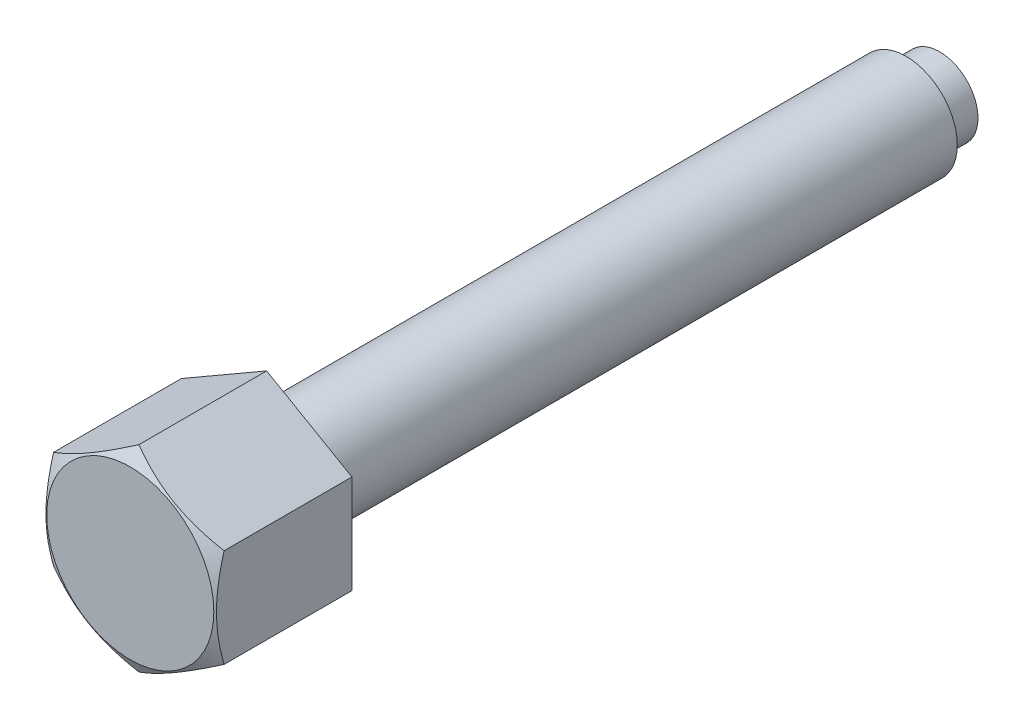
ISO-10303-21;
HEADER;
FILE_DESCRIPTION(('STEP AP214'),'2;1');
FILE_NAME('part.step','',(''),(''),'','','');
FILE_SCHEMA(('AUTOMOTIVE_DESIGN { 1 0 10303 214 1 1 1 1 }'));
ENDSEC;
DATA;
#1=APPLICATION_CONTEXT('core data for automotive mechanical design processes');
#2=APPLICATION_PROTOCOL_DEFINITION('international standard','automotive_design',2000,#1);
#3=PRODUCT_CONTEXT('',#1,'mechanical');
#4=PRODUCT('Part','Part','',(#3));
#5=PRODUCT_RELATED_PRODUCT_CATEGORY('part','',(#4));
#6=PRODUCT_DEFINITION_FORMATION('','',#4);
#7=PRODUCT_DEFINITION_CONTEXT('part definition',#1,'design');
#8=PRODUCT_DEFINITION('design','',#6,#7);
#9=PRODUCT_DEFINITION_SHAPE('','',#8);
#10=(LENGTH_UNIT() NAMED_UNIT(*) SI_UNIT(.MILLI.,.METRE.));
#11=(NAMED_UNIT(*) PLANE_ANGLE_UNIT() SI_UNIT($,.RADIAN.));
#12=(NAMED_UNIT(*) SI_UNIT($,.STERADIAN.) SOLID_ANGLE_UNIT());
#13=UNCERTAINTY_MEASURE_WITH_UNIT(LENGTH_MEASURE(1.E-05),#10,'distance_accuracy_value','');
#14=(GEOMETRIC_REPRESENTATION_CONTEXT(3) GLOBAL_UNCERTAINTY_ASSIGNED_CONTEXT((#13)) GLOBAL_UNIT_ASSIGNED_CONTEXT((#10,
#11,#12)) REPRESENTATION_CONTEXT('',''));
#15=CARTESIAN_POINT('',(0.,0.,0.));
#16=DIRECTION('',(0.,0.,1.));
#17=DIRECTION('',(1.,0.,0.));
#18=AXIS2_PLACEMENT_3D('',#15,#16,#17);
#19=CARTESIAN_POINT('',(0.,5.77350269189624,38.));
#20=DIRECTION('',(-0.5,-0.86602540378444,0.));
#21=DIRECTION('',(0.86602540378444,-0.5,0.));
#22=AXIS2_PLACEMENT_3D('',#19,#20,#21);
#23=PLANE('',#22);
#24=CARTESIAN_POINT('',(5.0002,2.88663587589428,47.4956163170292));
#25=CARTESIAN_POINT('',(4.78046540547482,3.01349970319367,47.5688784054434));
#26=CARTESIAN_POINT('',(4.55885141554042,3.14144859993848,47.635513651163));
#27=CARTESIAN_POINT('',(4.11178600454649,3.3995619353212,47.7518259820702));
#28=CARTESIAN_POINT('',(3.88632664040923,3.52973095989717,47.8014619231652));
#29=CARTESIAN_POINT('',(3.43816769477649,3.78847564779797,47.8787139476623));
#30=CARTESIAN_POINT('',(3.21553790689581,3.91701101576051,47.9068445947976));
#31=CARTESIAN_POINT('',(2.88081009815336,4.11026620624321,47.9320700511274));
#32=CARTESIAN_POINT('',(2.76915780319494,4.1747286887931,47.9376515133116));
#33=CARTESIAN_POINT('',(2.5457500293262,4.30371322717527,47.9430627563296));
#34=CARTESIAN_POINT('',(2.43399455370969,4.36823528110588,47.9428927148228));
#35=CARTESIAN_POINT('',(2.12781576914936,4.54500768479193,47.934511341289));
#36=CARTESIAN_POINT('',(1.93349391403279,4.65719946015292,47.9204352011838));
#37=CARTESIAN_POINT('',(1.5461398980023,4.8808384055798,47.8757997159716));
#38=CARTESIAN_POINT('',(1.35310909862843,4.99228478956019,47.8452251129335));
#39=CARTESIAN_POINT('',(0.96497465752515,5.21637431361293,47.7687964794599));
#40=CARTESIAN_POINT('',(0.769920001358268,5.32898917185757,47.7226185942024));
#41=CARTESIAN_POINT('',(0.382719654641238,5.55253939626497,47.6178131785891));
#42=CARTESIAN_POINT('',(0.190569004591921,5.6634776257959,47.5592102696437));
#43=CARTESIAN_POINT('',(-0.000199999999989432,5.77361816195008,47.4956163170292));
#44=B_SPLINE_CURVE_WITH_KNOTS('',3,(#24,#25,#26,#27,#28,#29,#30,#31,#32,#33,#34,#35,#36,#37,#38,
#39,#40,#41,#42,#43),.UNSPECIFIED.,.F.,.F.,(4,2,2,2,2,2,2,2,2,4),(0.,0.792555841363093,
1.58701660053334,2.36181537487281,2.74884076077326,3.13585419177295,3.80962362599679,
4.48401723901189,5.17336882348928,5.86136694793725),.UNSPECIFIED.);
#45=CARTESIAN_POINT('',(5.,2.88675134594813,47.4956829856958));
#46=VERTEX_POINT('',#45);
#47=CARTESIAN_POINT('',(0.,5.77350269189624,47.4956829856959));
#48=VERTEX_POINT('',#47);
#49=EDGE_CURVE('E30',#46,#48,#44,.T.);
#50=ORIENTED_EDGE('',*,*,#49,.F.);
#51=DIRECTION('',(0.,0.,1.));
#52=VECTOR('',#51,1.);
#53=CARTESIAN_POINT('',(5.,2.88675134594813,38.));
#54=LINE('',#53,#52);
#55=CARTESIAN_POINT('',(5.,2.88675134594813,40.));
#56=VERTEX_POINT('',#55);
#57=EDGE_CURVE('E97',#56,#46,#54,.T.);
#58=ORIENTED_EDGE('',*,*,#57,.F.);
#59=DIRECTION('',(0.86602540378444,-0.5,0.));
#60=VECTOR('',#59,1.);
#61=CARTESIAN_POINT('',(4.75,3.03108891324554,40.));
#62=LINE('',#61,#60);
#63=CARTESIAN_POINT('',(0.,5.77350269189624,40.));
#64=VERTEX_POINT('',#63);
#65=EDGE_CURVE('E111',#64,#56,#62,.T.);
#66=ORIENTED_EDGE('',*,*,#65,.F.);
#67=DIRECTION('',(0.,0.,1.));
#68=VECTOR('',#67,1.);
#69=CARTESIAN_POINT('',(0.,5.77350269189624,38.));
#70=LINE('',#69,#68);
#71=EDGE_CURVE('E37',#64,#48,#70,.T.);
#72=ORIENTED_EDGE('',*,*,#71,.T.);
#73=EDGE_LOOP('',(#50,#58,#66,#72));
#74=FACE_BOUND('',#73,.T.);
#75=ADVANCED_FACE('F15',(#74),#23,.F.);
#76=CARTESIAN_POINT('',(5.,2.88675134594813,38.));
#77=DIRECTION('',(-1.,0.,0.));
#78=DIRECTION('',(0.,-1.,0.));
#79=AXIS2_PLACEMENT_3D('',#76,#77,#78);
#80=PLANE('',#79);
#81=CARTESIAN_POINT('',(5.,-7.74269728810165,45.5076956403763));
#82=CARTESIAN_POINT('',(5.,-7.52441194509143,45.6135374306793));
#83=CARTESIAN_POINT('',(5.,-7.30562428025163,45.7183610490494));
#84=CARTESIAN_POINT('',(5.,-6.86677713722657,45.9253990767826));
#85=CARTESIAN_POINT('',(5.,-6.64671746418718,46.0276130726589));
#86=CARTESIAN_POINT('',(5.,-6.20391980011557,46.2293756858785));
#87=CARTESIAN_POINT('',(5.,-5.98117374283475,46.3289066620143));
#88=CARTESIAN_POINT('',(5.,-5.53390597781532,46.523880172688));
#89=CARTESIAN_POINT('',(5.,-5.30938435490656,46.6193229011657));
#90=CARTESIAN_POINT('',(5.,-4.85100219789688,46.8080064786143));
#91=CARTESIAN_POINT('',(5.,-4.61707232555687,46.9010798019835));
#92=CARTESIAN_POINT('',(5.,-4.14647145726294,47.0801544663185));
#93=CARTESIAN_POINT('',(5.,-3.90980015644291,47.1661550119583));
#94=CARTESIAN_POINT('',(5.,-3.43378669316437,47.3288180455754));
#95=CARTESIAN_POINT('',(5.,-3.19445109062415,47.4054995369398));
#96=CARTESIAN_POINT('',(5.,-2.7123467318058,47.5470562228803));
#97=CARTESIAN_POINT('',(5.,-2.46957908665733,47.6119351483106));
#98=CARTESIAN_POINT('',(5.,-1.98182033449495,47.7264204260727));
#99=CARTESIAN_POINT('',(5.,-1.73684895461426,47.7761092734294));
#100=CARTESIAN_POINT('',(5.,-1.24387164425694,47.8573986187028));
#101=CARTESIAN_POINT('',(5.,-0.995865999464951,47.8890008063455));
#102=CARTESIAN_POINT('',(5.,-0.501293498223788,47.931181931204));
#103=CARTESIAN_POINT('',(5.,-0.254750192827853,47.942030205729));
#104=CARTESIAN_POINT('',(5.,0.238375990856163,47.9424920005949));
#105=CARTESIAN_POINT('',(5.,0.484958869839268,47.9321050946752));
#106=CARTESIAN_POINT('',(5.,0.90392471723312,47.8971488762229));
#107=CARTESIAN_POINT('',(5.,1.07675716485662,47.877661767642));
#108=CARTESIAN_POINT('',(5.,1.42114176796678,47.8294746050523));
#109=CARTESIAN_POINT('',(5.,1.59269374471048,47.8007732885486));
#110=CARTESIAN_POINT('',(5.,2.10520930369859,47.7023581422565));
#111=CARTESIAN_POINT('',(5.,2.44383787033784,47.6203514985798));
#112=CARTESIAN_POINT('',(5.,2.95015975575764,47.4783435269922));
#113=CARTESIAN_POINT('',(5.,3.12048264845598,47.4271855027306));
#114=CARTESIAN_POINT('',(5.,3.45947349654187,47.3196045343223));
#115=CARTESIAN_POINT('',(5.,3.62814144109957,47.2631815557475));
#116=CARTESIAN_POINT('',(5.,3.96387674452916,47.1459720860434));
#117=CARTESIAN_POINT('',(5.,4.13094462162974,47.0851870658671));
#118=CARTESIAN_POINT('',(5.,4.46369949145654,46.9599637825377));
#119=CARTESIAN_POINT('',(5.,4.62938649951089,46.8955255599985));
#120=CARTESIAN_POINT('',(5.,5.01690876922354,46.7406768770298));
#121=CARTESIAN_POINT('',(5.,5.23824618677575,46.6490228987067));
#122=CARTESIAN_POINT('',(5.,5.67906585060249,46.4613452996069));
#123=CARTESIAN_POINT('',(5.,5.89854798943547,46.3653214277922));
#124=CARTESIAN_POINT('',(5.,6.33599444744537,46.1697725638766));
#125=CARTESIAN_POINT('',(5.,6.55395846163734,46.0702468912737));
#126=CARTESIAN_POINT('',(5.,6.98858190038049,45.8683824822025));
#127=CARTESIAN_POINT('',(5.,7.20524129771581,45.7660436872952));
#128=CARTESIAN_POINT('',(5.,7.85400206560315,45.4554209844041));
#129=CARTESIAN_POINT('',(5.,8.2844666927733,45.2437207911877));
#130=CARTESIAN_POINT('',(5.,9.1422990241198,44.8141370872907));
#131=CARTESIAN_POINT('',(5.,9.56966661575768,44.5962533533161));
#132=CARTESIAN_POINT('',(5.,10.1913950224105,44.2752143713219));
#133=CARTESIAN_POINT('',(5.,10.3866573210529,44.1737998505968));
#134=CARTESIAN_POINT('',(5.,10.7767567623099,43.9701648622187));
#135=CARTESIAN_POINT('',(5.,10.9715939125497,43.8679444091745));
#136=CARTESIAN_POINT('',(5.,11.5555700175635,43.560228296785));
#137=CARTESIAN_POINT('',(5.,11.9441576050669,43.3536861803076));
#138=CARTESIAN_POINT('',(5.,12.7192487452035,42.9389783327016));
#139=CARTESIAN_POINT('',(5.,13.1057550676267,42.7308177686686));
#140=CARTESIAN_POINT('',(5.,13.8778347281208,42.3128223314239));
#141=CARTESIAN_POINT('',(5.,14.263408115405,42.1029875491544));
#142=CARTESIAN_POINT('',(5.,14.6486370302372,41.8925262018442));
#143=B_SPLINE_CURVE_WITH_KNOTS('',3,(#81,#82,#83,#84,#85,#86,#87,#88,#89,#90,#91,#92,#93,#94,
#95,#96,#97,#98,#99,#100,#101,#102,#103,#104,#105,#106,#107,#108,#109,#110,#111,#112,#113,#114,
#115,#116,#117,#118,#119,#120,#121,#122,#123,#124,#125,#126,#127,#128,#129,#130,#131,#132,#133,
#134,#135,#136,#137,#138,#139,#140,#141,#142),.UNSPECIFIED.,.F.,.F.,(4,2,2,2,2,2,2,2,2,2,2,2,2,
2,2,2,2,2,2,2,2,2,2,2,2,2,2,2,2,2,4),(0.,0.727785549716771,1.45568570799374,2.18756810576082,
2.91941574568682,3.67462363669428,4.42991633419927,5.18364203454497,5.93712906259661,
6.68644818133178,7.43569728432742,8.17515511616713,8.91462779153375,9.43615726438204,
9.95775822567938,11.0015440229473,11.5350191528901,12.0684977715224,12.6017973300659,
13.1350909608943,13.8537187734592,14.5723879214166,15.2911975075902,16.0100220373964,
17.4490518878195,18.8881337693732,19.5482158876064,20.2082860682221,21.5284805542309,
22.8454659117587,24.1623802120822),.UNSPECIFIED.);
#144=CARTESIAN_POINT('',(5.,-2.88675134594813,47.4956829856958));
#145=VERTEX_POINT('',#144);
#146=EDGE_CURVE('E157',#145,#46,#143,.T.);
#147=ORIENTED_EDGE('',*,*,#146,.F.);
#148=DIRECTION('',(0.,0.,1.));
#149=VECTOR('',#148,1.);
#150=CARTESIAN_POINT('',(5.,-2.88675134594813,38.));
#151=LINE('',#150,#149);
#152=CARTESIAN_POINT('',(5.,-2.88675134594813,40.));
#153=VERTEX_POINT('',#152);
#154=EDGE_CURVE('E94',#153,#145,#151,.T.);
#155=ORIENTED_EDGE('',*,*,#154,.F.);
#156=DIRECTION('',(0.,-1.,0.));
#157=VECTOR('',#156,1.);
#158=CARTESIAN_POINT('',(5.,0.,40.));
#159=LINE('',#158,#157);
#160=EDGE_CURVE('E108',#56,#153,#159,.T.);
#161=ORIENTED_EDGE('',*,*,#160,.F.);
#162=ORIENTED_EDGE('',*,*,#57,.T.);
#163=EDGE_LOOP('',(#147,#155,#161,#162));
#164=FACE_BOUND('',#163,.T.);
#165=ADVANCED_FACE('F137',(#164),#80,.F.);
#166=CARTESIAN_POINT('',(0.,-5.77350269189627,38.));
#167=DIRECTION('',(0.5,-0.866025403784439,0.));
#168=DIRECTION('',(0.866025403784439,0.5,0.));
#169=AXIS2_PLACEMENT_3D('',#166,#167,#168);
#170=PLANE('',#169);
#171=ORIENTED_EDGE('',*,*,#154,.T.);
#172=CARTESIAN_POINT('',(5.0002,-2.88663587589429,47.4956163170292));
#173=CARTESIAN_POINT('',(4.78046540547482,-3.01349970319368,47.5688784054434));
#174=CARTESIAN_POINT('',(4.55885141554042,-3.14144859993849,47.6355136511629));
#175=CARTESIAN_POINT('',(4.11178600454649,-3.39956193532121,47.7518259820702));
#176=CARTESIAN_POINT('',(3.88632664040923,-3.52973095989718,47.8014619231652));
#177=CARTESIAN_POINT('',(3.43816769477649,-3.78847564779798,47.8787139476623));
#178=CARTESIAN_POINT('',(3.21553790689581,-3.91701101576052,47.9068445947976));
#179=CARTESIAN_POINT('',(2.88081009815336,-4.11026620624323,47.9320700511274));
#180=CARTESIAN_POINT('',(2.76915780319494,-4.17472868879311,47.9376515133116));
#181=CARTESIAN_POINT('',(2.5457500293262,-4.30371322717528,47.9430627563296));
#182=CARTESIAN_POINT('',(2.43399455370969,-4.36823528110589,47.9428927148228));
#183=CARTESIAN_POINT('',(2.12781576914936,-4.54500768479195,47.934511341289));
#184=CARTESIAN_POINT('',(1.93349391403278,-4.65719946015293,47.9204352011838));
#185=CARTESIAN_POINT('',(1.54613989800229,-4.88083840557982,47.8757997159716));
#186=CARTESIAN_POINT('',(1.35310909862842,-4.99228478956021,47.8452251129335));
#187=CARTESIAN_POINT('',(0.964974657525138,-5.21637431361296,47.7687964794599));
#188=CARTESIAN_POINT('',(0.769920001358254,-5.3289891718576,47.7226185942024));
#189=CARTESIAN_POINT('',(0.38271965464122,-5.55253939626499,47.6178131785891));
#190=CARTESIAN_POINT('',(0.190569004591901,-5.66347762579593,47.5592102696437));
#191=CARTESIAN_POINT('',(-0.000200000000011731,-5.77361816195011,47.4956163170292));
#192=B_SPLINE_CURVE_WITH_KNOTS('',3,(#172,#173,#174,#175,#176,#177,#178,#179,#180,#181,#182,
#183,#184,#185,#186,#187,#188,#189,#190,#191),.UNSPECIFIED.,.F.,.F.,(4,2,2,2,2,2,2,2,2,4),(0.,
0.79255584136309,1.58701660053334,2.36181537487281,2.74884076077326,3.13585419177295,
3.8096236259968,4.4840172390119,5.1733688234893,5.86136694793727),.UNSPECIFIED.);
#193=CARTESIAN_POINT('',(0.,-5.77350269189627,47.4956829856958));
#194=VERTEX_POINT('',#193);
#195=EDGE_CURVE('E163',#145,#194,#192,.T.);
#196=ORIENTED_EDGE('',*,*,#195,.T.);
#197=DIRECTION('',(0.,0.,1.));
#198=VECTOR('',#197,1.);
#199=CARTESIAN_POINT('',(0.,-5.77350269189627,38.));
#200=LINE('',#199,#198);
#201=CARTESIAN_POINT('',(0.,-5.77350269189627,40.));
#202=VERTEX_POINT('',#201);
#203=EDGE_CURVE('E87',#202,#194,#200,.T.);
#204=ORIENTED_EDGE('',*,*,#203,.F.);
#205=DIRECTION('',(0.866025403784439,0.5,0.));
#206=VECTOR('',#205,1.);
#207=CARTESIAN_POINT('',(4.75,-3.03108891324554,40.));
#208=LINE('',#207,#206);
#209=EDGE_CURVE('E106',#202,#153,#208,.T.);
#210=ORIENTED_EDGE('',*,*,#209,.T.);
#211=EDGE_LOOP('',(#171,#196,#204,#210));
#212=FACE_BOUND('',#211,.T.);
#213=ADVANCED_FACE('F143',(#212),#170,.T.);
#214=CARTESIAN_POINT('',(0.,-5.77350269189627,38.));
#215=DIRECTION('',(0.5,0.866025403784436,0.));
#216=DIRECTION('',(-0.866025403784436,0.5,0.));
#217=AXIS2_PLACEMENT_3D('',#214,#215,#216);
#218=PLANE('',#217);
#219=CARTESIAN_POINT('',(-5.0002,-2.8866358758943,47.4956163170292));
#220=CARTESIAN_POINT('',(-4.78046540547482,-3.01349970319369,47.5688784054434));
#221=CARTESIAN_POINT('',(-4.55885141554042,-3.1414485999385,47.6355136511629));
#222=CARTESIAN_POINT('',(-4.11178600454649,-3.39956193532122,47.7518259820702));
#223=CARTESIAN_POINT('',(-3.88632664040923,-3.52973095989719,47.8014619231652));
#224=CARTESIAN_POINT('',(-3.43816769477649,-3.78847564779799,47.8787139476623));
#225=CARTESIAN_POINT('',(-3.21553790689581,-3.91701101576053,47.9068445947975));
#226=CARTESIAN_POINT('',(-2.88081009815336,-4.11026620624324,47.9320700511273));
#227=CARTESIAN_POINT('',(-2.76915780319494,-4.17472868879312,47.9376515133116));
#228=CARTESIAN_POINT('',(-2.5457500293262,-4.30371322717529,47.9430627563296));
#229=CARTESIAN_POINT('',(-2.43399455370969,-4.3682352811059,47.9428927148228));
#230=CARTESIAN_POINT('',(-2.12781576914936,-4.54500768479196,47.934511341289));
#231=CARTESIAN_POINT('',(-1.93349391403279,-4.65719946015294,47.9204352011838));
#232=CARTESIAN_POINT('',(-1.5461398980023,-4.88083840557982,47.8757997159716));
#233=CARTESIAN_POINT('',(-1.35310909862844,-4.99228478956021,47.8452251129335));
#234=CARTESIAN_POINT('',(-0.964974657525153,-5.21637431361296,47.7687964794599));
#235=CARTESIAN_POINT('',(-0.769920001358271,-5.3289891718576,47.7226185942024));
#236=CARTESIAN_POINT('',(-0.38271965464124,-5.552539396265,47.6178131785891));
#237=CARTESIAN_POINT('',(-0.190569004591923,-5.66347762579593,47.5592102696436));
#238=CARTESIAN_POINT('',(0.000199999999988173,-5.77361816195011,47.4956163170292));
#239=B_SPLINE_CURVE_WITH_KNOTS('',3,(#219,#220,#221,#222,#223,#224,#225,#226,#227,#228,#229,
#230,#231,#232,#233,#234,#235,#236,#237,#238),.UNSPECIFIED.,.F.,.F.,(4,2,2,2,2,2,2,2,2,4),(0.,
0.792555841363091,1.58701660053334,2.36181537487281,2.74884076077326,3.13585419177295,
3.80962362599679,4.48401723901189,5.17336882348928,5.86136694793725),.UNSPECIFIED.);
#240=CARTESIAN_POINT('',(-5.,-2.88675134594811,47.4956829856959));
#241=VERTEX_POINT('',#240);
#242=EDGE_CURVE('E81',#241,#194,#239,.T.);
#243=ORIENTED_EDGE('',*,*,#242,.F.);
#244=DIRECTION('',(0.,0.,1.));
#245=VECTOR('',#244,1.);
#246=CARTESIAN_POINT('',(-5.,-2.88675134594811,38.));
#247=LINE('',#246,#245);
#248=CARTESIAN_POINT('',(-5.,-2.88675134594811,40.));
#249=VERTEX_POINT('',#248);
#250=EDGE_CURVE('E80',#249,#241,#247,.T.);
#251=ORIENTED_EDGE('',*,*,#250,.F.);
#252=DIRECTION('',(-0.866025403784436,0.5,0.));
#253=VECTOR('',#252,1.);
#254=CARTESIAN_POINT('',(-0.250000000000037,-5.62916512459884,40.));
#255=LINE('',#254,#253);
#256=EDGE_CURVE('E103',#202,#249,#255,.T.);
#257=ORIENTED_EDGE('',*,*,#256,.F.);
#258=ORIENTED_EDGE('',*,*,#203,.T.);
#259=EDGE_LOOP('',(#243,#251,#257,#258));
#260=FACE_BOUND('',#259,.T.);
#261=ADVANCED_FACE('F239',(#260),#218,.F.);
#262=CARTESIAN_POINT('',(-5.,2.88675134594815,38.));
#263=DIRECTION('',(-1.,0.,0.));
#264=DIRECTION('',(0.,-1.,0.));
#265=AXIS2_PLACEMENT_3D('',#262,#263,#264);
#266=PLANE('',#265);
#267=ORIENTED_EDGE('',*,*,#250,.T.);
#268=CARTESIAN_POINT('',(-5.,-7.74269728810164,45.5076956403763));
#269=CARTESIAN_POINT('',(-5.,-7.52441194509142,45.6135374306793));
#270=CARTESIAN_POINT('',(-5.,-7.30562428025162,45.7183610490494));
#271=CARTESIAN_POINT('',(-5.,-6.86677713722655,45.9253990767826));
#272=CARTESIAN_POINT('',(-5.,-6.64671746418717,46.0276130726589));
#273=CARTESIAN_POINT('',(-5.,-6.20391980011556,46.2293756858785));
#274=CARTESIAN_POINT('',(-5.,-5.98117374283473,46.3289066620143));
#275=CARTESIAN_POINT('',(-5.,-5.53390597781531,46.523880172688));
#276=CARTESIAN_POINT('',(-5.,-5.30938435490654,46.6193229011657));
#277=CARTESIAN_POINT('',(-5.,-4.85100219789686,46.8080064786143));
#278=CARTESIAN_POINT('',(-5.,-4.61707232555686,46.9010798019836));
#279=CARTESIAN_POINT('',(-5.,-4.14647145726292,47.0801544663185));
#280=CARTESIAN_POINT('',(-5.,-3.90980015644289,47.1661550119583));
#281=CARTESIAN_POINT('',(-5.,-3.43378669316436,47.3288180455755));
#282=CARTESIAN_POINT('',(-5.,-3.19445109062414,47.4054995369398));
#283=CARTESIAN_POINT('',(-5.,-2.71234673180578,47.5470562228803));
#284=CARTESIAN_POINT('',(-5.,-2.46957908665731,47.6119351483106));
#285=CARTESIAN_POINT('',(-5.,-1.98182033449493,47.7264204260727));
#286=CARTESIAN_POINT('',(-5.,-1.73684895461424,47.7761092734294));
#287=CARTESIAN_POINT('',(-5.,-1.24387164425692,47.8573986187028));
#288=CARTESIAN_POINT('',(-5.,-0.995865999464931,47.8890008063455));
#289=CARTESIAN_POINT('',(-5.,-0.501293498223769,47.931181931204));
#290=CARTESIAN_POINT('',(-5.,-0.254750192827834,47.942030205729));
#291=CARTESIAN_POINT('',(-5.,0.238375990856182,47.9424920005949));
#292=CARTESIAN_POINT('',(-5.,0.484958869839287,47.9321050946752));
#293=CARTESIAN_POINT('',(-5.,0.903924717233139,47.8971488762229));
#294=CARTESIAN_POINT('',(-5.,1.07675716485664,47.877661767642));
#295=CARTESIAN_POINT('',(-5.,1.42114176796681,47.8294746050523));
#296=CARTESIAN_POINT('',(-5.,1.59269374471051,47.8007732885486));
#297=CARTESIAN_POINT('',(-5.,2.10520930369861,47.7023581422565));
#298=CARTESIAN_POINT('',(-5.,2.44383787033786,47.6203514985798));
#299=CARTESIAN_POINT('',(-5.,2.95015975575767,47.4783435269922));
#300=CARTESIAN_POINT('',(-5.,3.12048264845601,47.4271855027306));
#301=CARTESIAN_POINT('',(-5.,3.45947349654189,47.3196045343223));
#302=CARTESIAN_POINT('',(-5.,3.62814144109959,47.2631815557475));
#303=CARTESIAN_POINT('',(-5.,3.96387674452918,47.1459720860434));
#304=CARTESIAN_POINT('',(-5.,4.13094462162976,47.0851870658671));
#305=CARTESIAN_POINT('',(-5.,4.46369949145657,46.9599637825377));
#306=CARTESIAN_POINT('',(-5.,4.62938649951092,46.8955255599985));
#307=CARTESIAN_POINT('',(-5.,5.01690876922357,46.7406768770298));
#308=CARTESIAN_POINT('',(-5.,5.23824618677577,46.6490228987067));
#309=CARTESIAN_POINT('',(-5.,5.67906585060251,46.4613452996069));
#310=CARTESIAN_POINT('',(-5.,5.8985479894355,46.3653214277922));
#311=CARTESIAN_POINT('',(-5.,6.3359944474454,46.1697725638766));
#312=CARTESIAN_POINT('',(-5.,6.55395846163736,46.0702468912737));
#313=CARTESIAN_POINT('',(-5.,6.98858190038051,45.8683824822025));
#314=CARTESIAN_POINT('',(-5.,7.20524129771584,45.7660436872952));
#315=CARTESIAN_POINT('',(-5.,7.85400206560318,45.4554209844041));
#316=CARTESIAN_POINT('',(-5.,8.28446669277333,45.2437207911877));
#317=CARTESIAN_POINT('',(-5.,9.14229902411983,44.8141370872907));
#318=CARTESIAN_POINT('',(-5.,9.56966661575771,44.5962533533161));
#319=CARTESIAN_POINT('',(-5.,10.1913950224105,44.2752143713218));
#320=CARTESIAN_POINT('',(-5.,10.3866573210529,44.1737998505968));
#321=CARTESIAN_POINT('',(-5.,10.7767567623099,43.9701648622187));
#322=CARTESIAN_POINT('',(-5.,10.9715939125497,43.8679444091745));
#323=CARTESIAN_POINT('',(-5.,11.5555700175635,43.560228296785));
#324=CARTESIAN_POINT('',(-5.,11.9441576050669,43.3536861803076));
#325=CARTESIAN_POINT('',(-5.,12.7192487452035,42.9389783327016));
#326=CARTESIAN_POINT('',(-5.,13.1057550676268,42.7308177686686));
#327=CARTESIAN_POINT('',(-5.,13.8778347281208,42.3128223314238));
#328=CARTESIAN_POINT('',(-5.,14.263408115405,42.1029875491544));
#329=CARTESIAN_POINT('',(-5.,14.6486370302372,41.8925262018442));
#330=B_SPLINE_CURVE_WITH_KNOTS('',3,(#268,#269,#270,#271,#272,#273,#274,#275,#276,#277,#278,
#279,#280,#281,#282,#283,#284,#285,#286,#287,#288,#289,#290,#291,#292,#293,#294,#295,#296,#297,
#298,#299,#300,#301,#302,#303,#304,#305,#306,#307,#308,#309,#310,#311,#312,#313,#314,#315,#316,
#317,#318,#319,#320,#321,#322,#323,#324,#325,#326,#327,#328,#329),.UNSPECIFIED.,.F.,.F.,(4,2,2,
2,2,2,2,2,2,2,2,2,2,2,2,2,2,2,2,2,2,2,2,2,2,2,2,2,2,2,4),(0.,0.727785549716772,1.45568570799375,
2.18756810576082,2.91941574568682,3.67462363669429,4.42991633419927,5.18364203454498,
5.93712906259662,6.68644818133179,7.43569728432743,8.17515511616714,8.91462779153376,
9.43615726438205,9.9577582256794,11.0015440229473,11.5350191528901,12.0684977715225,
12.601797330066,13.1350909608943,13.8537187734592,14.5723879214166,15.2911975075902,
16.0100220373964,17.4490518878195,18.8881337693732,19.5482158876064,20.2082860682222,
21.528480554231,22.8454659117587,24.1623802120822),.UNSPECIFIED.);
#331=CARTESIAN_POINT('',(-5.,2.88675134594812,47.4956829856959));
#332=VERTEX_POINT('',#331);
#333=EDGE_CURVE('E68',#241,#332,#330,.T.);
#334=ORIENTED_EDGE('',*,*,#333,.T.);
#335=DIRECTION('',(0.,0.,1.));
#336=VECTOR('',#335,1.);
#337=CARTESIAN_POINT('',(-5.,2.88675134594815,38.));
#338=LINE('',#337,#336);
#339=CARTESIAN_POINT('',(-5.,2.88675134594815,40.));
#340=VERTEX_POINT('',#339);
#341=EDGE_CURVE('E77',#340,#332,#338,.T.);
#342=ORIENTED_EDGE('',*,*,#341,.F.);
#343=DIRECTION('',(0.,-1.,0.));
#344=VECTOR('',#343,1.);
#345=CARTESIAN_POINT('',(-5.,0.,40.));
#346=LINE('',#345,#344);
#347=EDGE_CURVE('E101',#340,#249,#346,.T.);
#348=ORIENTED_EDGE('',*,*,#347,.T.);
#349=EDGE_LOOP('',(#267,#334,#342,#348));
#350=FACE_BOUND('',#349,.T.);
#351=ADVANCED_FACE('F76',(#350),#266,.T.);
#352=CARTESIAN_POINT('',(0.,5.77350269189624,38.));
#353=DIRECTION('',(-0.5,0.866025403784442,0.));
#354=DIRECTION('',(-0.866025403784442,-0.5,0.));
#355=AXIS2_PLACEMENT_3D('',#352,#353,#354);
#356=PLANE('',#355);
#357=ORIENTED_EDGE('',*,*,#341,.T.);
#358=CARTESIAN_POINT('',(-5.0002,2.88663587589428,47.4956163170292));
#359=CARTESIAN_POINT('',(-4.78046540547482,3.01349970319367,47.5688784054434));
#360=CARTESIAN_POINT('',(-4.55885141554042,3.14144859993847,47.6355136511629));
#361=CARTESIAN_POINT('',(-4.11178600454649,3.39956193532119,47.7518259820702));
#362=CARTESIAN_POINT('',(-3.88632664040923,3.52973095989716,47.8014619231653));
#363=CARTESIAN_POINT('',(-3.43816769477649,3.78847564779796,47.8787139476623));
#364=CARTESIAN_POINT('',(-3.21553790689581,3.9170110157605,47.9068445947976));
#365=CARTESIAN_POINT('',(-2.88081009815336,4.1102662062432,47.9320700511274));
#366=CARTESIAN_POINT('',(-2.76915780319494,4.17472868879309,47.9376515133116));
#367=CARTESIAN_POINT('',(-2.54575002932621,4.30371322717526,47.9430627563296));
#368=CARTESIAN_POINT('',(-2.43399455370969,4.36823528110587,47.9428927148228));
#369=CARTESIAN_POINT('',(-2.12781576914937,4.54500768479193,47.934511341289));
#370=CARTESIAN_POINT('',(-1.93349391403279,4.65719946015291,47.9204352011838));
#371=CARTESIAN_POINT('',(-1.54613989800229,4.88083840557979,47.8757997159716));
#372=CARTESIAN_POINT('',(-1.35310909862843,4.99228478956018,47.8452251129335));
#373=CARTESIAN_POINT('',(-0.964974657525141,5.21637431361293,47.7687964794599));
#374=CARTESIAN_POINT('',(-0.769920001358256,5.32898917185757,47.7226185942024));
#375=CARTESIAN_POINT('',(-0.38271965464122,5.55253939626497,47.6178131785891));
#376=CARTESIAN_POINT('',(-0.190569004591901,5.6634776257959,47.5592102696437));
#377=CARTESIAN_POINT('',(0.000200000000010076,5.77361816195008,47.4956163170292));
#378=B_SPLINE_CURVE_WITH_KNOTS('',3,(#358,#359,#360,#361,#362,#363,#364,#365,#366,#367,#368,
#369,#370,#371,#372,#373,#374,#375,#376,#377),.UNSPECIFIED.,.F.,.F.,(4,2,2,2,2,2,2,2,2,4),(0.,
0.79255584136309,1.58701660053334,2.3618153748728,2.74884076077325,3.13585419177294,
3.80962362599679,4.48401723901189,5.17336882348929,5.86136694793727),.UNSPECIFIED.);
#379=EDGE_CURVE('E65',#332,#48,#378,.T.);
#380=ORIENTED_EDGE('',*,*,#379,.T.);
#381=ORIENTED_EDGE('',*,*,#71,.F.);
#382=DIRECTION('',(-0.866025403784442,-0.5,0.));
#383=VECTOR('',#382,1.);
#384=CARTESIAN_POINT('',(-0.249999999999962,5.62916512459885,40.));
#385=LINE('',#384,#383);
#386=EDGE_CURVE('E85',#64,#340,#385,.T.);
#387=ORIENTED_EDGE('',*,*,#386,.T.);
#388=EDGE_LOOP('',(#357,#380,#381,#387));
#389=FACE_BOUND('',#388,.T.);
#390=ADVANCED_FACE('F83',(#389),#356,.T.);
#391=CARTESIAN_POINT('',(0.,0.,5.));
#392=DIRECTION('',(0.,0.,1.));
#393=DIRECTION('',(1.,0.,0.));
#394=AXIS2_PLACEMENT_3D('',#391,#392,#393);
#395=SPHERICAL_SURFACE('',#394,5.);
#396=CARTESIAN_POINT('',(0.,0.,0.53485722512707));
#397=DIRECTION('',(0.,0.,1.));
#398=DIRECTION('',(1.,0.,0.));
#399=AXIS2_PLACEMENT_3D('',#396,#397,#398);
#400=CIRCLE('',#399,2.25);
#401=CARTESIAN_POINT('',(2.25,0.,0.53485722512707));
#402=VERTEX_POINT('',#401);
#403=EDGE_CURVE('E9',#402,#402,#400,.T.);
#404=ORIENTED_EDGE('',*,*,#403,.F.);
#405=EDGE_LOOP('',(#404));
#406=FACE_BOUND('',#405,.T.);
#407=ADVANCED_FACE('F17',(#406),#395,.T.);
#408=CARTESIAN_POINT('',(0.,0.,110.));
#409=DIRECTION('',(0.,0.,1.));
#410=DIRECTION('',(1.,0.,0.));
#411=AXIS2_PLACEMENT_3D('',#408,#409,#410);
#412=CYLINDRICAL_SURFACE('',#411,2.25);
#413=ORIENTED_EDGE('',*,*,#403,.T.);
#414=EDGE_LOOP('',(#413));
#415=FACE_BOUND('',#414,.T.);
#416=CARTESIAN_POINT('',(0.,0.,2.5));
#417=DIRECTION('',(0.,0.,1.));
#418=DIRECTION('',(1.,0.,0.));
#419=AXIS2_PLACEMENT_3D('',#416,#417,#418);
#420=CIRCLE('',#419,2.25);
#421=CARTESIAN_POINT('',(2.25,0.,2.5));
#422=VERTEX_POINT('',#421);
#423=EDGE_CURVE('E23',#422,#422,#420,.T.);
#424=ORIENTED_EDGE('',*,*,#423,.F.);
#425=EDGE_LOOP('',(#424));
#426=FACE_BOUND('',#425,.T.);
#427=ADVANCED_FACE('F124',(#415,#426),#412,.T.);
#428=CARTESIAN_POINT('',(2.25,0.,2.5));
#429=DIRECTION('',(0.,0.,1.));
#430=DIRECTION('',(1.,0.,0.));
#431=AXIS2_PLACEMENT_3D('',#428,#429,#430);
#432=PLANE('',#431);
#433=CARTESIAN_POINT('',(0.,0.,2.5));
#434=DIRECTION('',(0.,0.,1.));
#435=DIRECTION('',(1.,0.,0.));
#436=AXIS2_PLACEMENT_3D('',#433,#434,#435);
#437=CIRCLE('',#436,3.);
#438=CARTESIAN_POINT('',(3.,0.,2.5));
#439=VERTEX_POINT('',#438);
#440=EDGE_CURVE('E117',#439,#439,#437,.T.);
#441=ORIENTED_EDGE('',*,*,#440,.F.);
#442=EDGE_LOOP('',(#441));
#443=FACE_BOUND('',#442,.T.);
#444=ORIENTED_EDGE('',*,*,#423,.T.);
#445=EDGE_LOOP('',(#444));
#446=FACE_BOUND('',#445,.T.);
#447=ADVANCED_FACE('F122',(#443,#446),#432,.F.);
#448=CARTESIAN_POINT('',(0.,0.,110.));
#449=DIRECTION('',(0.,0.,1.));
#450=DIRECTION('',(1.,0.,0.));
#451=AXIS2_PLACEMENT_3D('',#448,#449,#450);
#452=CYLINDRICAL_SURFACE('',#451,3.);
#453=CARTESIAN_POINT('',(0.,0.,40.));
#454=DIRECTION('',(0.,0.,1.));
#455=DIRECTION('',(1.,0.,0.));
#456=AXIS2_PLACEMENT_3D('',#453,#454,#455);
#457=CIRCLE('',#456,3.);
#458=CARTESIAN_POINT('',(3.,0.,40.));
#459=VERTEX_POINT('',#458);
#460=EDGE_CURVE('E114',#459,#459,#457,.T.);
#461=ORIENTED_EDGE('',*,*,#460,.F.);
#462=EDGE_LOOP('',(#461));
#463=FACE_BOUND('',#462,.T.);
#464=ORIENTED_EDGE('',*,*,#440,.T.);
#465=EDGE_LOOP('',(#464));
#466=FACE_BOUND('',#465,.T.);
#467=ADVANCED_FACE('F132',(#463,#466),#452,.T.);
#468=CARTESIAN_POINT('',(3.,0.,40.));
#469=DIRECTION('',(0.,0.,1.));
#470=DIRECTION('',(1.,0.,0.));
#471=AXIS2_PLACEMENT_3D('',#468,#469,#470);
#472=PLANE('',#471);
#473=ORIENTED_EDGE('',*,*,#386,.F.);
#474=ORIENTED_EDGE('',*,*,#65,.T.);
#475=ORIENTED_EDGE('',*,*,#160,.T.);
#476=ORIENTED_EDGE('',*,*,#209,.F.);
#477=ORIENTED_EDGE('',*,*,#256,.T.);
#478=ORIENTED_EDGE('',*,*,#347,.F.);
#479=EDGE_LOOP('',(#473,#474,#475,#476,#477,#478));
#480=FACE_BOUND('',#479,.T.);
#481=ORIENTED_EDGE('',*,*,#460,.T.);
#482=EDGE_LOOP('',(#481));
#483=FACE_BOUND('',#482,.T.);
#484=ADVANCED_FACE('F178',(#480,#483),#472,.F.);
#485=CARTESIAN_POINT('',(0.,0.,48.));
#486=DIRECTION('',(0.,0.,-1.));
#487=DIRECTION('',(-1.,0.,0.));
#488=AXIS2_PLACEMENT_3D('',#485,#486,#487);
#489=CONICAL_SURFACE('',#488,4.9,1.0471975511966);
#490=CARTESIAN_POINT('',(0.,0.,48.));
#491=DIRECTION('',(0.,0.,1.));
#492=DIRECTION('',(1.,0.,0.));
#493=AXIS2_PLACEMENT_3D('',#490,#491,#492);
#494=CIRCLE('',#493,4.9);
#495=CARTESIAN_POINT('',(4.9,0.,48.));
#496=VERTEX_POINT('',#495);
#497=EDGE_CURVE('E71',#496,#496,#494,.T.);
#498=ORIENTED_EDGE('',*,*,#497,.F.);
#499=EDGE_LOOP('',(#498));
#500=FACE_BOUND('',#499,.T.);
#501=ORIENTED_EDGE('',*,*,#49,.T.);
#502=ORIENTED_EDGE('',*,*,#379,.F.);
#503=ORIENTED_EDGE('',*,*,#333,.F.);
#504=ORIENTED_EDGE('',*,*,#242,.T.);
#505=ORIENTED_EDGE('',*,*,#195,.F.);
#506=ORIENTED_EDGE('',*,*,#146,.T.);
#507=EDGE_LOOP('',(#501,#502,#503,#504,#505,#506));
#508=FACE_BOUND('',#507,.T.);
#509=ADVANCED_FACE('F67',(#500,#508),#489,.T.);
#510=CARTESIAN_POINT('',(0.,0.,48.));
#511=DIRECTION('',(0.,0.,1.));
#512=DIRECTION('',(1.,0.,0.));
#513=AXIS2_PLACEMENT_3D('',#510,#511,#512);
#514=PLANE('',#513);
#515=ORIENTED_EDGE('',*,*,#497,.T.);
#516=EDGE_LOOP('',(#515));
#517=FACE_BOUND('',#516,.T.);
#518=ADVANCED_FACE('F174',(#517),#514,.T.);
#519=CLOSED_SHELL('',(#75,#165,#213,#261,#351,#390,#407,#427,#447,#467,#484,#509,#518));
#520=MANIFOLD_SOLID_BREP('B1',#519);
#521=ADVANCED_BREP_SHAPE_REPRESENTATION('',(#18,#520),#14);
#522=SHAPE_DEFINITION_REPRESENTATION(#9,#521);
ENDSEC;
END-ISO-10303-21;
